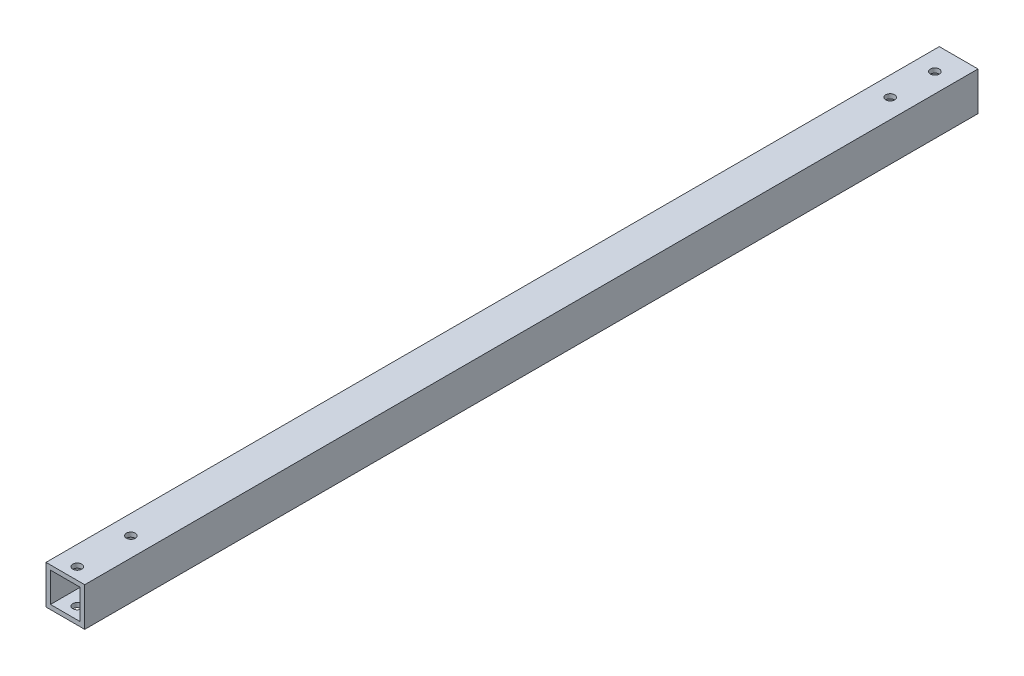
ISO-10303-21;
HEADER;
FILE_DESCRIPTION(('STEP AP214'),'2;1');
FILE_NAME('part.step','',(''),(''),'','','');
FILE_SCHEMA(('AUTOMOTIVE_DESIGN { 1 0 10303 214 1 1 1 1 }'));
ENDSEC;
DATA;
#1=APPLICATION_CONTEXT('core data for automotive mechanical design processes');
#2=APPLICATION_PROTOCOL_DEFINITION('international standard','automotive_design',2000,#1);
#3=PRODUCT_CONTEXT('',#1,'mechanical');
#4=PRODUCT('Part','Part','',(#3));
#5=PRODUCT_RELATED_PRODUCT_CATEGORY('part','',(#4));
#6=PRODUCT_DEFINITION_FORMATION('','',#4);
#7=PRODUCT_DEFINITION_CONTEXT('part definition',#1,'design');
#8=PRODUCT_DEFINITION('design','',#6,#7);
#9=PRODUCT_DEFINITION_SHAPE('','',#8);
#10=(LENGTH_UNIT() NAMED_UNIT(*) SI_UNIT(.MILLI.,.METRE.));
#11=(NAMED_UNIT(*) PLANE_ANGLE_UNIT() SI_UNIT($,.RADIAN.));
#12=(NAMED_UNIT(*) SI_UNIT($,.STERADIAN.) SOLID_ANGLE_UNIT());
#13=UNCERTAINTY_MEASURE_WITH_UNIT(LENGTH_MEASURE(1.E-05),#10,'distance_accuracy_value','');
#14=(GEOMETRIC_REPRESENTATION_CONTEXT(3) GLOBAL_UNCERTAINTY_ASSIGNED_CONTEXT((#13)) GLOBAL_UNIT_ASSIGNED_CONTEXT((#10,
#11,#12)) REPRESENTATION_CONTEXT('',''));
#15=CARTESIAN_POINT('',(0.,0.,0.));
#16=DIRECTION('',(0.,0.,1.));
#17=DIRECTION('',(1.,0.,0.));
#18=AXIS2_PLACEMENT_3D('',#15,#16,#17);
#19=CARTESIAN_POINT('',(6.5,6.5,300.));
#20=DIRECTION('',(-1.,0.,0.));
#21=DIRECTION('',(0.,-1.,0.));
#22=AXIS2_PLACEMENT_3D('',#19,#20,#21);
#23=PLANE('',#22);
#24=DIRECTION('',(0.,1.,0.));
#25=VECTOR('',#24,1.);
#26=CARTESIAN_POINT('',(6.5,6.5,0.));
#27=LINE('',#26,#25);
#28=CARTESIAN_POINT('',(6.5,-6.5,0.));
#29=VERTEX_POINT('',#28);
#30=CARTESIAN_POINT('',(6.5,6.5,0.));
#31=VERTEX_POINT('',#30);
#32=EDGE_CURVE('E148',#29,#31,#27,.T.);
#33=ORIENTED_EDGE('',*,*,#32,.T.);
#34=DIRECTION('',(0.,0.,-1.));
#35=VECTOR('',#34,1.);
#36=CARTESIAN_POINT('',(6.5,6.5,300.));
#37=LINE('',#36,#35);
#38=CARTESIAN_POINT('',(6.5,6.5,300.));
#39=VERTEX_POINT('',#38);
#40=EDGE_CURVE('E11',#39,#31,#37,.T.);
#41=ORIENTED_EDGE('',*,*,#40,.F.);
#42=DIRECTION('',(0.,1.,0.));
#43=VECTOR('',#42,1.);
#44=CARTESIAN_POINT('',(6.5,6.5,300.));
#45=LINE('',#44,#43);
#46=CARTESIAN_POINT('',(6.5,-6.5,300.));
#47=VERTEX_POINT('',#46);
#48=EDGE_CURVE('E137',#47,#39,#45,.T.);
#49=ORIENTED_EDGE('',*,*,#48,.F.);
#50=DIRECTION('',(0.,0.,-1.));
#51=VECTOR('',#50,1.);
#52=CARTESIAN_POINT('',(6.5,-6.5,300.));
#53=LINE('',#52,#51);
#54=EDGE_CURVE('E147',#47,#29,#53,.T.);
#55=ORIENTED_EDGE('',*,*,#54,.T.);
#56=EDGE_LOOP('',(#33,#41,#49,#55));
#57=FACE_BOUND('',#56,.T.);
#58=ADVANCED_FACE('F37',(#57),#23,.F.);
#59=CARTESIAN_POINT('',(-6.5,6.5,300.));
#60=DIRECTION('',(0.,-1.,0.));
#61=DIRECTION('',(0.,0.,-1.));
#62=AXIS2_PLACEMENT_3D('',#59,#60,#61);
#63=PLANE('',#62);
#64=CARTESIAN_POINT('',(0.,6.5,278.));
#65=DIRECTION('',(0.,1.,0.));
#66=DIRECTION('',(0.,0.,1.));
#67=AXIS2_PLACEMENT_3D('',#64,#65,#66);
#68=CIRCLE('',#67,1.5);
#69=CARTESIAN_POINT('',(0.,6.5,279.5));
#70=VERTEX_POINT('',#69);
#71=EDGE_CURVE('E311',#70,#70,#68,.T.);
#72=ORIENTED_EDGE('',*,*,#71,.F.);
#73=EDGE_LOOP('',(#72));
#74=FACE_BOUND('',#73,.T.);
#75=CARTESIAN_POINT('',(0.,6.5,296.));
#76=DIRECTION('',(0.,1.,0.));
#77=DIRECTION('',(0.,0.,1.));
#78=AXIS2_PLACEMENT_3D('',#75,#76,#77);
#79=CIRCLE('',#78,1.5);
#80=CARTESIAN_POINT('',(0.,6.5,297.5));
#81=VERTEX_POINT('',#80);
#82=EDGE_CURVE('E181',#81,#81,#79,.T.);
#83=ORIENTED_EDGE('',*,*,#82,.F.);
#84=EDGE_LOOP('',(#83));
#85=FACE_BOUND('',#84,.T.);
#86=CARTESIAN_POINT('',(0.,6.5,23.));
#87=DIRECTION('',(0.,1.,0.));
#88=DIRECTION('',(0.,0.,1.));
#89=AXIS2_PLACEMENT_3D('',#86,#87,#88);
#90=CIRCLE('',#89,1.5);
#91=CARTESIAN_POINT('',(0.,6.5,24.5));
#92=VERTEX_POINT('',#91);
#93=EDGE_CURVE('E178',#92,#92,#90,.T.);
#94=ORIENTED_EDGE('',*,*,#93,.F.);
#95=EDGE_LOOP('',(#94));
#96=FACE_BOUND('',#95,.T.);
#97=CARTESIAN_POINT('',(0.,6.5,8.));
#98=DIRECTION('',(0.,1.,0.));
#99=DIRECTION('',(0.,0.,1.));
#100=AXIS2_PLACEMENT_3D('',#97,#98,#99);
#101=CIRCLE('',#100,1.5);
#102=CARTESIAN_POINT('',(0.,6.5,9.5));
#103=VERTEX_POINT('',#102);
#104=EDGE_CURVE('E197',#103,#103,#101,.T.);
#105=ORIENTED_EDGE('',*,*,#104,.F.);
#106=EDGE_LOOP('',(#105));
#107=FACE_BOUND('',#106,.T.);
#108=DIRECTION('',(-1.,0.,0.));
#109=VECTOR('',#108,1.);
#110=CARTESIAN_POINT('',(-6.5,6.5,0.));
#111=LINE('',#110,#109);
#112=CARTESIAN_POINT('',(-6.5,6.5,0.));
#113=VERTEX_POINT('',#112);
#114=EDGE_CURVE('E151',#31,#113,#111,.T.);
#115=ORIENTED_EDGE('',*,*,#114,.T.);
#116=DIRECTION('',(0.,0.,-1.));
#117=VECTOR('',#116,1.);
#118=CARTESIAN_POINT('',(-6.5,6.5,300.));
#119=LINE('',#118,#117);
#120=CARTESIAN_POINT('',(-6.5,6.5,300.));
#121=VERTEX_POINT('',#120);
#122=EDGE_CURVE('E45',#121,#113,#119,.T.);
#123=ORIENTED_EDGE('',*,*,#122,.F.);
#124=DIRECTION('',(-1.,0.,0.));
#125=VECTOR('',#124,1.);
#126=CARTESIAN_POINT('',(-6.5,6.5,300.));
#127=LINE('',#126,#125);
#128=EDGE_CURVE('E140',#39,#121,#127,.T.);
#129=ORIENTED_EDGE('',*,*,#128,.F.);
#130=ORIENTED_EDGE('',*,*,#40,.T.);
#131=EDGE_LOOP('',(#115,#123,#129,#130));
#132=FACE_BOUND('',#131,.T.);
#133=ADVANCED_FACE('F226',(#74,#85,#96,#107,#132),#63,.F.);
#134=CARTESIAN_POINT('',(-6.5,6.5,300.));
#135=DIRECTION('',(1.,0.,0.));
#136=DIRECTION('',(0.,1.,0.));
#137=AXIS2_PLACEMENT_3D('',#134,#135,#136);
#138=PLANE('',#137);
#139=DIRECTION('',(0.,-1.,0.));
#140=VECTOR('',#139,1.);
#141=CARTESIAN_POINT('',(-6.5,6.5,0.));
#142=LINE('',#141,#140);
#143=CARTESIAN_POINT('',(-6.5,-6.5,0.));
#144=VERTEX_POINT('',#143);
#145=EDGE_CURVE('E153',#113,#144,#142,.T.);
#146=ORIENTED_EDGE('',*,*,#145,.T.);
#147=DIRECTION('',(0.,0.,-1.));
#148=VECTOR('',#147,1.);
#149=CARTESIAN_POINT('',(-6.5,-6.5,300.));
#150=LINE('',#149,#148);
#151=CARTESIAN_POINT('',(-6.5,-6.5,300.));
#152=VERTEX_POINT('',#151);
#153=EDGE_CURVE('E158',#152,#144,#150,.T.);
#154=ORIENTED_EDGE('',*,*,#153,.F.);
#155=DIRECTION('',(0.,-1.,0.));
#156=VECTOR('',#155,1.);
#157=CARTESIAN_POINT('',(-6.5,6.5,300.));
#158=LINE('',#157,#156);
#159=EDGE_CURVE('E143',#121,#152,#158,.T.);
#160=ORIENTED_EDGE('',*,*,#159,.F.);
#161=ORIENTED_EDGE('',*,*,#122,.T.);
#162=EDGE_LOOP('',(#146,#154,#160,#161));
#163=FACE_BOUND('',#162,.T.);
#164=ADVANCED_FACE('F231',(#163),#138,.F.);
#165=CARTESIAN_POINT('',(-6.5,-6.5,300.));
#166=DIRECTION('',(0.,1.,0.));
#167=DIRECTION('',(0.,0.,1.));
#168=AXIS2_PLACEMENT_3D('',#165,#166,#167);
#169=PLANE('',#168);
#170=CARTESIAN_POINT('',(0.,-6.5,278.));
#171=DIRECTION('',(0.,1.,0.));
#172=DIRECTION('',(0.,0.,1.));
#173=AXIS2_PLACEMENT_3D('',#170,#171,#172);
#174=CIRCLE('',#173,1.5);
#175=CARTESIAN_POINT('',(0.,-6.5,279.5));
#176=VERTEX_POINT('',#175);
#177=EDGE_CURVE('E310',#176,#176,#174,.T.);
#178=ORIENTED_EDGE('',*,*,#177,.T.);
#179=EDGE_LOOP('',(#178));
#180=FACE_BOUND('',#179,.T.);
#181=CARTESIAN_POINT('',(0.,-6.5,296.));
#182=DIRECTION('',(0.,1.,0.));
#183=DIRECTION('',(0.,0.,1.));
#184=AXIS2_PLACEMENT_3D('',#181,#182,#183);
#185=CIRCLE('',#184,1.5);
#186=CARTESIAN_POINT('',(0.,-6.5,297.5));
#187=VERTEX_POINT('',#186);
#188=EDGE_CURVE('E174',#187,#187,#185,.T.);
#189=ORIENTED_EDGE('',*,*,#188,.T.);
#190=EDGE_LOOP('',(#189));
#191=FACE_BOUND('',#190,.T.);
#192=CARTESIAN_POINT('',(0.,-6.5,23.));
#193=DIRECTION('',(0.,1.,0.));
#194=DIRECTION('',(0.,0.,1.));
#195=AXIS2_PLACEMENT_3D('',#192,#193,#194);
#196=CIRCLE('',#195,1.5);
#197=CARTESIAN_POINT('',(0.,-6.5,24.5));
#198=VERTEX_POINT('',#197);
#199=EDGE_CURVE('E170',#198,#198,#196,.T.);
#200=ORIENTED_EDGE('',*,*,#199,.T.);
#201=EDGE_LOOP('',(#200));
#202=FACE_BOUND('',#201,.T.);
#203=CARTESIAN_POINT('',(0.,-6.5,8.));
#204=DIRECTION('',(0.,1.,0.));
#205=DIRECTION('',(0.,0.,1.));
#206=AXIS2_PLACEMENT_3D('',#203,#204,#205);
#207=CIRCLE('',#206,1.5);
#208=CARTESIAN_POINT('',(0.,-6.5,9.5));
#209=VERTEX_POINT('',#208);
#210=EDGE_CURVE('E166',#209,#209,#207,.T.);
#211=ORIENTED_EDGE('',*,*,#210,.T.);
#212=EDGE_LOOP('',(#211));
#213=FACE_BOUND('',#212,.T.);
#214=DIRECTION('',(1.,0.,0.));
#215=VECTOR('',#214,1.);
#216=CARTESIAN_POINT('',(-6.5,-6.5,0.));
#217=LINE('',#216,#215);
#218=EDGE_CURVE('E141',#144,#29,#217,.T.);
#219=ORIENTED_EDGE('',*,*,#218,.T.);
#220=ORIENTED_EDGE('',*,*,#54,.F.);
#221=DIRECTION('',(1.,0.,0.));
#222=VECTOR('',#221,1.);
#223=CARTESIAN_POINT('',(-6.5,-6.5,300.));
#224=LINE('',#223,#222);
#225=EDGE_CURVE('E145',#152,#47,#224,.T.);
#226=ORIENTED_EDGE('',*,*,#225,.F.);
#227=ORIENTED_EDGE('',*,*,#153,.T.);
#228=EDGE_LOOP('',(#219,#220,#226,#227));
#229=FACE_BOUND('',#228,.T.);
#230=ADVANCED_FACE('F245',(#180,#191,#202,#213,#229),#169,.F.);
#231=CARTESIAN_POINT('',(0.,0.,300.));
#232=DIRECTION('',(0.,0.,1.));
#233=DIRECTION('',(1.,0.,0.));
#234=AXIS2_PLACEMENT_3D('',#231,#232,#233);
#235=PLANE('',#234);
#236=DIRECTION('',(0.,1.,0.));
#237=VECTOR('',#236,1.);
#238=CARTESIAN_POINT('',(5.,6.5,300.));
#239=LINE('',#238,#237);
#240=CARTESIAN_POINT('',(5.,-5.,300.));
#241=VERTEX_POINT('',#240);
#242=CARTESIAN_POINT('',(5.,5.,300.));
#243=VERTEX_POINT('',#242);
#244=EDGE_CURVE('E125',#241,#243,#239,.T.);
#245=ORIENTED_EDGE('',*,*,#244,.F.);
#246=DIRECTION('',(1.,0.,0.));
#247=VECTOR('',#246,1.);
#248=CARTESIAN_POINT('',(-6.5,-5.,300.));
#249=LINE('',#248,#247);
#250=CARTESIAN_POINT('',(-5.,-5.,300.));
#251=VERTEX_POINT('',#250);
#252=EDGE_CURVE('E108',#251,#241,#249,.T.);
#253=ORIENTED_EDGE('',*,*,#252,.F.);
#254=DIRECTION('',(0.,-1.,0.));
#255=VECTOR('',#254,1.);
#256=CARTESIAN_POINT('',(-5.,6.5,300.));
#257=LINE('',#256,#255);
#258=CARTESIAN_POINT('',(-5.,5.,300.));
#259=VERTEX_POINT('',#258);
#260=EDGE_CURVE('E134',#259,#251,#257,.T.);
#261=ORIENTED_EDGE('',*,*,#260,.F.);
#262=DIRECTION('',(-1.,0.,0.));
#263=VECTOR('',#262,1.);
#264=CARTESIAN_POINT('',(-6.5,5.,300.));
#265=LINE('',#264,#263);
#266=EDGE_CURVE('E127',#243,#259,#265,.T.);
#267=ORIENTED_EDGE('',*,*,#266,.F.);
#268=EDGE_LOOP('',(#245,#253,#261,#267));
#269=FACE_BOUND('',#268,.T.);
#270=ORIENTED_EDGE('',*,*,#48,.T.);
#271=ORIENTED_EDGE('',*,*,#128,.T.);
#272=ORIENTED_EDGE('',*,*,#159,.T.);
#273=ORIENTED_EDGE('',*,*,#225,.T.);
#274=EDGE_LOOP('',(#270,#271,#272,#273));
#275=FACE_BOUND('',#274,.T.);
#276=ADVANCED_FACE('F210',(#269,#275),#235,.T.);
#277=CARTESIAN_POINT('',(0.,0.,0.));
#278=DIRECTION('',(0.,0.,1.));
#279=DIRECTION('',(1.,0.,0.));
#280=AXIS2_PLACEMENT_3D('',#277,#278,#279);
#281=PLANE('',#280);
#282=DIRECTION('',(1.,0.,0.));
#283=VECTOR('',#282,1.);
#284=CARTESIAN_POINT('',(-6.5,-5.,0.));
#285=LINE('',#284,#283);
#286=CARTESIAN_POINT('',(-5.,-5.,0.));
#287=VERTEX_POINT('',#286);
#288=CARTESIAN_POINT('',(5.,-5.,0.));
#289=VERTEX_POINT('',#288);
#290=EDGE_CURVE('E106',#287,#289,#285,.T.);
#291=ORIENTED_EDGE('',*,*,#290,.T.);
#292=DIRECTION('',(0.,1.,0.));
#293=VECTOR('',#292,1.);
#294=CARTESIAN_POINT('',(5.,6.5,0.));
#295=LINE('',#294,#293);
#296=CARTESIAN_POINT('',(5.,5.,0.));
#297=VERTEX_POINT('',#296);
#298=EDGE_CURVE('E114',#289,#297,#295,.T.);
#299=ORIENTED_EDGE('',*,*,#298,.T.);
#300=DIRECTION('',(-1.,0.,0.));
#301=VECTOR('',#300,1.);
#302=CARTESIAN_POINT('',(-6.5,5.,0.));
#303=LINE('',#302,#301);
#304=CARTESIAN_POINT('',(-5.,5.,0.));
#305=VERTEX_POINT('',#304);
#306=EDGE_CURVE('E120',#297,#305,#303,.T.);
#307=ORIENTED_EDGE('',*,*,#306,.T.);
#308=DIRECTION('',(0.,-1.,0.));
#309=VECTOR('',#308,1.);
#310=CARTESIAN_POINT('',(-5.,6.5,0.));
#311=LINE('',#310,#309);
#312=EDGE_CURVE('E60',#305,#287,#311,.T.);
#313=ORIENTED_EDGE('',*,*,#312,.T.);
#314=EDGE_LOOP('',(#291,#299,#307,#313));
#315=FACE_BOUND('',#314,.T.);
#316=ORIENTED_EDGE('',*,*,#32,.F.);
#317=ORIENTED_EDGE('',*,*,#218,.F.);
#318=ORIENTED_EDGE('',*,*,#145,.F.);
#319=ORIENTED_EDGE('',*,*,#114,.F.);
#320=EDGE_LOOP('',(#316,#317,#318,#319));
#321=FACE_BOUND('',#320,.T.);
#322=ADVANCED_FACE('F123',(#315,#321),#281,.F.);
#323=CARTESIAN_POINT('',(5.,6.5,300.));
#324=DIRECTION('',(-1.,0.,0.));
#325=DIRECTION('',(0.,-1.,0.));
#326=AXIS2_PLACEMENT_3D('',#323,#324,#325);
#327=PLANE('',#326);
#328=ORIENTED_EDGE('',*,*,#298,.F.);
#329=DIRECTION('',(0.,0.,-1.));
#330=VECTOR('',#329,1.);
#331=CARTESIAN_POINT('',(5.,-5.,300.));
#332=LINE('',#331,#330);
#333=EDGE_CURVE('E102',#241,#289,#332,.T.);
#334=ORIENTED_EDGE('',*,*,#333,.F.);
#335=ORIENTED_EDGE('',*,*,#244,.T.);
#336=DIRECTION('',(0.,0.,-1.));
#337=VECTOR('',#336,1.);
#338=CARTESIAN_POINT('',(5.,5.,300.));
#339=LINE('',#338,#337);
#340=EDGE_CURVE('E117',#243,#297,#339,.T.);
#341=ORIENTED_EDGE('',*,*,#340,.T.);
#342=EDGE_LOOP('',(#328,#334,#335,#341));
#343=FACE_BOUND('',#342,.T.);
#344=ADVANCED_FACE('F115',(#343),#327,.T.);
#345=CARTESIAN_POINT('',(-6.5,5.,300.));
#346=DIRECTION('',(0.,-1.,0.));
#347=DIRECTION('',(0.,0.,-1.));
#348=AXIS2_PLACEMENT_3D('',#345,#346,#347);
#349=PLANE('',#348);
#350=CARTESIAN_POINT('',(0.,5.,278.));
#351=DIRECTION('',(0.,-1.,0.));
#352=DIRECTION('',(0.,0.,-1.));
#353=AXIS2_PLACEMENT_3D('',#350,#351,#352);
#354=CIRCLE('',#353,1.5);
#355=CARTESIAN_POINT('',(0.,5.,279.5));
#356=VERTEX_POINT('',#355);
#357=EDGE_CURVE('E186',#356,#356,#354,.T.);
#358=ORIENTED_EDGE('',*,*,#357,.F.);
#359=EDGE_LOOP('',(#358));
#360=FACE_BOUND('',#359,.T.);
#361=CARTESIAN_POINT('',(0.,5.,296.));
#362=DIRECTION('',(0.,-1.,0.));
#363=DIRECTION('',(0.,0.,-1.));
#364=AXIS2_PLACEMENT_3D('',#361,#362,#363);
#365=CIRCLE('',#364,1.5);
#366=CARTESIAN_POINT('',(0.,5.,297.5));
#367=VERTEX_POINT('',#366);
#368=EDGE_CURVE('E173',#367,#367,#365,.T.);
#369=ORIENTED_EDGE('',*,*,#368,.F.);
#370=EDGE_LOOP('',(#369));
#371=FACE_BOUND('',#370,.T.);
#372=CARTESIAN_POINT('',(0.,5.,23.));
#373=DIRECTION('',(0.,-1.,0.));
#374=DIRECTION('',(0.,0.,-1.));
#375=AXIS2_PLACEMENT_3D('',#372,#373,#374);
#376=CIRCLE('',#375,1.5);
#377=CARTESIAN_POINT('',(0.,5.,24.5));
#378=VERTEX_POINT('',#377);
#379=EDGE_CURVE('E169',#378,#378,#376,.T.);
#380=ORIENTED_EDGE('',*,*,#379,.F.);
#381=EDGE_LOOP('',(#380));
#382=FACE_BOUND('',#381,.T.);
#383=CARTESIAN_POINT('',(0.,5.,8.));
#384=DIRECTION('',(0.,-1.,0.));
#385=DIRECTION('',(0.,0.,-1.));
#386=AXIS2_PLACEMENT_3D('',#383,#384,#385);
#387=CIRCLE('',#386,1.5);
#388=CARTESIAN_POINT('',(0.,5.,9.5));
#389=VERTEX_POINT('',#388);
#390=EDGE_CURVE('E121',#389,#389,#387,.T.);
#391=ORIENTED_EDGE('',*,*,#390,.F.);
#392=EDGE_LOOP('',(#391));
#393=FACE_BOUND('',#392,.T.);
#394=ORIENTED_EDGE('',*,*,#306,.F.);
#395=ORIENTED_EDGE('',*,*,#340,.F.);
#396=ORIENTED_EDGE('',*,*,#266,.T.);
#397=DIRECTION('',(0.,0.,-1.));
#398=VECTOR('',#397,1.);
#399=CARTESIAN_POINT('',(-5.,5.,300.));
#400=LINE('',#399,#398);
#401=EDGE_CURVE('E204',#259,#305,#400,.T.);
#402=ORIENTED_EDGE('',*,*,#401,.T.);
#403=EDGE_LOOP('',(#394,#395,#396,#402));
#404=FACE_BOUND('',#403,.T.);
#405=ADVANCED_FACE('F213',(#360,#371,#382,#393,#404),#349,.T.);
#406=CARTESIAN_POINT('',(-5.,6.5,300.));
#407=DIRECTION('',(1.,0.,0.));
#408=DIRECTION('',(0.,1.,0.));
#409=AXIS2_PLACEMENT_3D('',#406,#407,#408);
#410=PLANE('',#409);
#411=ORIENTED_EDGE('',*,*,#312,.F.);
#412=ORIENTED_EDGE('',*,*,#401,.F.);
#413=ORIENTED_EDGE('',*,*,#260,.T.);
#414=DIRECTION('',(0.,0.,-1.));
#415=VECTOR('',#414,1.);
#416=CARTESIAN_POINT('',(-5.,-5.,300.));
#417=LINE('',#416,#415);
#418=EDGE_CURVE('E53',#251,#287,#417,.T.);
#419=ORIENTED_EDGE('',*,*,#418,.T.);
#420=EDGE_LOOP('',(#411,#412,#413,#419));
#421=FACE_BOUND('',#420,.T.);
#422=ADVANCED_FACE('F206',(#421),#410,.T.);
#423=CARTESIAN_POINT('',(-6.5,-5.,300.));
#424=DIRECTION('',(0.,1.,0.));
#425=DIRECTION('',(0.,0.,1.));
#426=AXIS2_PLACEMENT_3D('',#423,#424,#425);
#427=PLANE('',#426);
#428=CARTESIAN_POINT('',(0.,-5.,278.));
#429=DIRECTION('',(0.,1.,0.));
#430=DIRECTION('',(0.,0.,1.));
#431=AXIS2_PLACEMENT_3D('',#428,#429,#430);
#432=CIRCLE('',#431,1.5);
#433=CARTESIAN_POINT('',(0.,-5.,279.5));
#434=VERTEX_POINT('',#433);
#435=EDGE_CURVE('E40',#434,#434,#432,.T.);
#436=ORIENTED_EDGE('',*,*,#435,.F.);
#437=EDGE_LOOP('',(#436));
#438=FACE_BOUND('',#437,.T.);
#439=CARTESIAN_POINT('',(0.,-5.,296.));
#440=DIRECTION('',(0.,1.,0.));
#441=DIRECTION('',(0.,0.,1.));
#442=AXIS2_PLACEMENT_3D('',#439,#440,#441);
#443=CIRCLE('',#442,1.5);
#444=CARTESIAN_POINT('',(0.,-5.,297.5));
#445=VERTEX_POINT('',#444);
#446=EDGE_CURVE('E171',#445,#445,#443,.T.);
#447=ORIENTED_EDGE('',*,*,#446,.F.);
#448=EDGE_LOOP('',(#447));
#449=FACE_BOUND('',#448,.T.);
#450=CARTESIAN_POINT('',(0.,-5.,23.));
#451=DIRECTION('',(0.,1.,0.));
#452=DIRECTION('',(0.,0.,1.));
#453=AXIS2_PLACEMENT_3D('',#450,#451,#452);
#454=CIRCLE('',#453,1.5);
#455=CARTESIAN_POINT('',(0.,-5.,24.5));
#456=VERTEX_POINT('',#455);
#457=EDGE_CURVE('E167',#456,#456,#454,.T.);
#458=ORIENTED_EDGE('',*,*,#457,.F.);
#459=EDGE_LOOP('',(#458));
#460=FACE_BOUND('',#459,.T.);
#461=CARTESIAN_POINT('',(0.,-5.,8.));
#462=DIRECTION('',(0.,1.,0.));
#463=DIRECTION('',(0.,0.,1.));
#464=AXIS2_PLACEMENT_3D('',#461,#462,#463);
#465=CIRCLE('',#464,1.5);
#466=CARTESIAN_POINT('',(0.,-5.,9.5));
#467=VERTEX_POINT('',#466);
#468=EDGE_CURVE('E163',#467,#467,#465,.T.);
#469=ORIENTED_EDGE('',*,*,#468,.F.);
#470=EDGE_LOOP('',(#469));
#471=FACE_BOUND('',#470,.T.);
#472=ORIENTED_EDGE('',*,*,#290,.F.);
#473=ORIENTED_EDGE('',*,*,#418,.F.);
#474=ORIENTED_EDGE('',*,*,#252,.T.);
#475=ORIENTED_EDGE('',*,*,#333,.T.);
#476=EDGE_LOOP('',(#472,#473,#474,#475));
#477=FACE_BOUND('',#476,.T.);
#478=ADVANCED_FACE('F104',(#438,#449,#460,#471,#477),#427,.T.);
#479=CARTESIAN_POINT('',(0.,-6.5,8.));
#480=DIRECTION('',(0.,1.,0.));
#481=DIRECTION('',(0.,0.,1.));
#482=AXIS2_PLACEMENT_3D('',#479,#480,#481);
#483=CYLINDRICAL_SURFACE('',#482,1.5);
#484=CARTESIAN_POINT('',(0.,-5.,9.5));
#485=CARTESIAN_POINT('',(0.,-5.015625,9.5));
#486=CARTESIAN_POINT('',(0.,-5.03125,9.5));
#487=CARTESIAN_POINT('',(0.,-5.0625,9.5));
#488=CARTESIAN_POINT('',(0.,-5.078125,9.5));
#489=CARTESIAN_POINT('',(0.,-5.109375,9.5));
#490=CARTESIAN_POINT('',(0.,-5.125,9.5));
#491=CARTESIAN_POINT('',(0.,-5.15625,9.5));
#492=CARTESIAN_POINT('',(0.,-5.171875,9.5));
#493=CARTESIAN_POINT('',(0.,-5.203125,9.5));
#494=CARTESIAN_POINT('',(0.,-5.21875,9.5));
#495=CARTESIAN_POINT('',(0.,-5.25,9.5));
#496=CARTESIAN_POINT('',(0.,-5.265625,9.5));
#497=CARTESIAN_POINT('',(0.,-5.296875,9.5));
#498=CARTESIAN_POINT('',(0.,-5.3125,9.5));
#499=CARTESIAN_POINT('',(0.,-5.34375,9.5));
#500=CARTESIAN_POINT('',(0.,-5.359375,9.5));
#501=CARTESIAN_POINT('',(0.,-5.390625,9.5));
#502=CARTESIAN_POINT('',(0.,-5.40625,9.5));
#503=CARTESIAN_POINT('',(0.,-5.4375,9.5));
#504=CARTESIAN_POINT('',(0.,-5.453125,9.5));
#505=CARTESIAN_POINT('',(0.,-5.484375,9.5));
#506=CARTESIAN_POINT('',(0.,-5.5,9.5));
#507=CARTESIAN_POINT('',(0.,-5.53125,9.5));
#508=CARTESIAN_POINT('',(0.,-5.546875,9.5));
#509=CARTESIAN_POINT('',(0.,-5.578125,9.5));
#510=CARTESIAN_POINT('',(0.,-5.59375,9.5));
#511=CARTESIAN_POINT('',(0.,-5.625,9.5));
#512=CARTESIAN_POINT('',(0.,-5.640625,9.5));
#513=CARTESIAN_POINT('',(0.,-5.671875,9.5));
#514=CARTESIAN_POINT('',(0.,-5.6875,9.5));
#515=CARTESIAN_POINT('',(0.,-5.71875,9.5));
#516=CARTESIAN_POINT('',(0.,-5.734375,9.5));
#517=CARTESIAN_POINT('',(0.,-5.765625,9.5));
#518=CARTESIAN_POINT('',(0.,-5.78125,9.5));
#519=CARTESIAN_POINT('',(0.,-5.8125,9.5));
#520=CARTESIAN_POINT('',(0.,-5.828125,9.5));
#521=CARTESIAN_POINT('',(0.,-5.859375,9.5));
#522=CARTESIAN_POINT('',(0.,-5.875,9.5));
#523=CARTESIAN_POINT('',(0.,-5.90625,9.5));
#524=CARTESIAN_POINT('',(0.,-5.921875,9.5));
#525=CARTESIAN_POINT('',(0.,-5.953125,9.5));
#526=CARTESIAN_POINT('',(0.,-5.96875,9.5));
#527=CARTESIAN_POINT('',(0.,-6.,9.5));
#528=CARTESIAN_POINT('',(0.,-6.015625,9.5));
#529=CARTESIAN_POINT('',(0.,-6.046875,9.5));
#530=CARTESIAN_POINT('',(0.,-6.0625,9.5));
#531=CARTESIAN_POINT('',(0.,-6.09375,9.5));
#532=CARTESIAN_POINT('',(0.,-6.109375,9.5));
#533=CARTESIAN_POINT('',(0.,-6.140625,9.5));
#534=CARTESIAN_POINT('',(0.,-6.15625,9.5));
#535=CARTESIAN_POINT('',(0.,-6.1875,9.5));
#536=CARTESIAN_POINT('',(0.,-6.203125,9.5));
#537=CARTESIAN_POINT('',(0.,-6.234375,9.5));
#538=CARTESIAN_POINT('',(0.,-6.25,9.5));
#539=CARTESIAN_POINT('',(0.,-6.28125,9.5));
#540=CARTESIAN_POINT('',(0.,-6.296875,9.5));
#541=CARTESIAN_POINT('',(0.,-6.328125,9.5));
#542=CARTESIAN_POINT('',(0.,-6.34375,9.5));
#543=CARTESIAN_POINT('',(0.,-6.375,9.5));
#544=CARTESIAN_POINT('',(0.,-6.390625,9.5));
#545=CARTESIAN_POINT('',(0.,-6.421875,9.5));
#546=CARTESIAN_POINT('',(0.,-6.4375,9.5));
#547=CARTESIAN_POINT('',(0.,-6.46875,9.5));
#548=CARTESIAN_POINT('',(0.,-6.484375,9.5));
#549=CARTESIAN_POINT('',(0.,-6.5,9.5));
#550=B_SPLINE_CURVE_WITH_KNOTS('',3,(#484,#485,#486,#487,#488,#489,#490,#491,#492,#493,#494,
#495,#496,#497,#498,#499,#500,#501,#502,#503,#504,#505,#506,#507,#508,#509,#510,#511,#512,#513,
#514,#515,#516,#517,#518,#519,#520,#521,#522,#523,#524,#525,#526,#527,#528,#529,#530,#531,#532,
#533,#534,#535,#536,#537,#538,#539,#540,#541,#542,#543,#544,#545,#546,#547,#548,#549),
.UNSPECIFIED.,.F.,.F.,(4,2,2,2,2,2,2,2,2,2,2,2,2,2,2,2,2,2,2,2,2,2,2,2,2,2,2,2,2,2,2,2,4),(0.,
0.046875,0.0937500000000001,0.140625,0.1875,0.234374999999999,0.281249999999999,
0.328124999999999,0.374999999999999,0.421875,0.46875,0.515625,0.5625,0.609375,0.65625,0.703125,
0.75,0.796875,0.84375,0.890625,0.9375,0.984375,1.03125,1.078125,1.125,1.171875,1.21875,1.265625,
1.3125,1.359375,1.40625,1.453125,1.5),.UNSPECIFIED.);
#551=EDGE_CURVE('BSEAM260',#467,#209,#550,.T.);
#552=ORIENTED_EDGE('',*,*,#468,.T.);
#553=ORIENTED_EDGE('',*,*,#210,.F.);
#554=ORIENTED_EDGE('',*,*,#551,.T.);
#555=ORIENTED_EDGE('',*,*,#551,.F.);
#556=EDGE_LOOP('',(#552,#554,#553,#555));
#557=FACE_BOUND('',#556,.T.);
#558=ADVANCED_FACE('F260',(#557),#483,.F.);
#559=CARTESIAN_POINT('',(0.,5.,9.5));
#560=CARTESIAN_POINT('',(0.,5.015625,9.5));
#561=CARTESIAN_POINT('',(0.,5.03125,9.5));
#562=CARTESIAN_POINT('',(0.,5.0625,9.5));
#563=CARTESIAN_POINT('',(0.,5.078125,9.5));
#564=CARTESIAN_POINT('',(0.,5.109375,9.5));
#565=CARTESIAN_POINT('',(0.,5.125,9.5));
#566=CARTESIAN_POINT('',(0.,5.15625,9.5));
#567=CARTESIAN_POINT('',(0.,5.171875,9.5));
#568=CARTESIAN_POINT('',(0.,5.203125,9.5));
#569=CARTESIAN_POINT('',(0.,5.21875,9.5));
#570=CARTESIAN_POINT('',(0.,5.25,9.5));
#571=CARTESIAN_POINT('',(0.,5.265625,9.5));
#572=CARTESIAN_POINT('',(0.,5.296875,9.5));
#573=CARTESIAN_POINT('',(0.,5.3125,9.5));
#574=CARTESIAN_POINT('',(0.,5.34375,9.5));
#575=CARTESIAN_POINT('',(0.,5.359375,9.5));
#576=CARTESIAN_POINT('',(0.,5.390625,9.5));
#577=CARTESIAN_POINT('',(0.,5.40625,9.5));
#578=CARTESIAN_POINT('',(0.,5.4375,9.5));
#579=CARTESIAN_POINT('',(0.,5.453125,9.5));
#580=CARTESIAN_POINT('',(0.,5.484375,9.5));
#581=CARTESIAN_POINT('',(0.,5.5,9.5));
#582=CARTESIAN_POINT('',(0.,5.53125,9.5));
#583=CARTESIAN_POINT('',(0.,5.546875,9.5));
#584=CARTESIAN_POINT('',(0.,5.578125,9.5));
#585=CARTESIAN_POINT('',(0.,5.59375,9.5));
#586=CARTESIAN_POINT('',(0.,5.625,9.5));
#587=CARTESIAN_POINT('',(0.,5.640625,9.5));
#588=CARTESIAN_POINT('',(0.,5.671875,9.5));
#589=CARTESIAN_POINT('',(0.,5.6875,9.5));
#590=CARTESIAN_POINT('',(0.,5.71875,9.5));
#591=CARTESIAN_POINT('',(0.,5.734375,9.5));
#592=CARTESIAN_POINT('',(0.,5.765625,9.5));
#593=CARTESIAN_POINT('',(0.,5.78125,9.5));
#594=CARTESIAN_POINT('',(0.,5.8125,9.5));
#595=CARTESIAN_POINT('',(0.,5.828125,9.5));
#596=CARTESIAN_POINT('',(0.,5.859375,9.5));
#597=CARTESIAN_POINT('',(0.,5.875,9.5));
#598=CARTESIAN_POINT('',(0.,5.90625,9.5));
#599=CARTESIAN_POINT('',(0.,5.921875,9.5));
#600=CARTESIAN_POINT('',(0.,5.953125,9.5));
#601=CARTESIAN_POINT('',(0.,5.96875,9.5));
#602=CARTESIAN_POINT('',(0.,6.,9.5));
#603=CARTESIAN_POINT('',(0.,6.015625,9.5));
#604=CARTESIAN_POINT('',(0.,6.046875,9.5));
#605=CARTESIAN_POINT('',(0.,6.0625,9.5));
#606=CARTESIAN_POINT('',(0.,6.09375,9.5));
#607=CARTESIAN_POINT('',(0.,6.109375,9.5));
#608=CARTESIAN_POINT('',(0.,6.140625,9.5));
#609=CARTESIAN_POINT('',(0.,6.15625,9.5));
#610=CARTESIAN_POINT('',(0.,6.1875,9.5));
#611=CARTESIAN_POINT('',(0.,6.203125,9.5));
#612=CARTESIAN_POINT('',(0.,6.234375,9.5));
#613=CARTESIAN_POINT('',(0.,6.25,9.5));
#614=CARTESIAN_POINT('',(0.,6.28125,9.5));
#615=CARTESIAN_POINT('',(0.,6.296875,9.5));
#616=CARTESIAN_POINT('',(0.,6.328125,9.5));
#617=CARTESIAN_POINT('',(0.,6.34375,9.5));
#618=CARTESIAN_POINT('',(0.,6.375,9.5));
#619=CARTESIAN_POINT('',(0.,6.390625,9.5));
#620=CARTESIAN_POINT('',(0.,6.421875,9.5));
#621=CARTESIAN_POINT('',(0.,6.4375,9.5));
#622=CARTESIAN_POINT('',(0.,6.46875,9.5));
#623=CARTESIAN_POINT('',(0.,6.484375,9.5));
#624=CARTESIAN_POINT('',(0.,6.5,9.5));
#625=B_SPLINE_CURVE_WITH_KNOTS('',3,(#559,#560,#561,#562,#563,#564,#565,#566,#567,#568,#569,
#570,#571,#572,#573,#574,#575,#576,#577,#578,#579,#580,#581,#582,#583,#584,#585,#586,#587,#588,
#589,#590,#591,#592,#593,#594,#595,#596,#597,#598,#599,#600,#601,#602,#603,#604,#605,#606,#607,
#608,#609,#610,#611,#612,#613,#614,#615,#616,#617,#618,#619,#620,#621,#622,#623,#624),
.UNSPECIFIED.,.F.,.F.,(4,2,2,2,2,2,2,2,2,2,2,2,2,2,2,2,2,2,2,2,2,2,2,2,2,2,2,2,2,2,2,2,4),(0.,
0.046875,0.0937500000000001,0.140625,0.1875,0.234375,0.28125,0.328125,0.375,0.421874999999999,
0.468749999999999,0.515624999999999,0.562499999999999,0.609374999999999,0.656249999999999,
0.703124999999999,0.749999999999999,0.796874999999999,0.843749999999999,0.890624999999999,
0.937499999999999,0.984374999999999,1.03125,1.078125,1.125,1.171875,1.21875,1.265625,1.3125,
1.359375,1.40625,1.453125,1.5),.UNSPECIFIED.);
#626=EDGE_CURVE('BSEAM265',#389,#103,#625,.T.);
#627=ORIENTED_EDGE('',*,*,#390,.T.);
#628=ORIENTED_EDGE('',*,*,#104,.T.);
#629=ORIENTED_EDGE('',*,*,#626,.T.);
#630=ORIENTED_EDGE('',*,*,#626,.F.);
#631=EDGE_LOOP('',(#627,#629,#628,#630));
#632=FACE_BOUND('',#631,.T.);
#633=ADVANCED_FACE('F265',(#632),#483,.F.);
#634=CARTESIAN_POINT('',(0.,-6.5,23.));
#635=DIRECTION('',(0.,1.,0.));
#636=DIRECTION('',(0.,0.,1.));
#637=AXIS2_PLACEMENT_3D('',#634,#635,#636);
#638=CYLINDRICAL_SURFACE('',#637,1.5);
#639=CARTESIAN_POINT('',(0.,-5.,24.5));
#640=CARTESIAN_POINT('',(0.,-5.015625,24.5));
#641=CARTESIAN_POINT('',(0.,-5.03125,24.5));
#642=CARTESIAN_POINT('',(0.,-5.0625,24.5));
#643=CARTESIAN_POINT('',(0.,-5.078125,24.5));
#644=CARTESIAN_POINT('',(0.,-5.109375,24.5));
#645=CARTESIAN_POINT('',(0.,-5.125,24.5));
#646=CARTESIAN_POINT('',(0.,-5.15625,24.5));
#647=CARTESIAN_POINT('',(0.,-5.171875,24.5));
#648=CARTESIAN_POINT('',(0.,-5.203125,24.5));
#649=CARTESIAN_POINT('',(0.,-5.21875,24.5));
#650=CARTESIAN_POINT('',(0.,-5.25,24.5));
#651=CARTESIAN_POINT('',(0.,-5.265625,24.5));
#652=CARTESIAN_POINT('',(0.,-5.296875,24.5));
#653=CARTESIAN_POINT('',(0.,-5.3125,24.5));
#654=CARTESIAN_POINT('',(0.,-5.34375,24.5));
#655=CARTESIAN_POINT('',(0.,-5.359375,24.5));
#656=CARTESIAN_POINT('',(0.,-5.390625,24.5));
#657=CARTESIAN_POINT('',(0.,-5.40625,24.5));
#658=CARTESIAN_POINT('',(0.,-5.4375,24.5));
#659=CARTESIAN_POINT('',(0.,-5.453125,24.5));
#660=CARTESIAN_POINT('',(0.,-5.484375,24.5));
#661=CARTESIAN_POINT('',(0.,-5.5,24.5));
#662=CARTESIAN_POINT('',(0.,-5.53125,24.5));
#663=CARTESIAN_POINT('',(0.,-5.546875,24.5));
#664=CARTESIAN_POINT('',(0.,-5.578125,24.5));
#665=CARTESIAN_POINT('',(0.,-5.59375,24.5));
#666=CARTESIAN_POINT('',(0.,-5.625,24.5));
#667=CARTESIAN_POINT('',(0.,-5.640625,24.5));
#668=CARTESIAN_POINT('',(0.,-5.671875,24.5));
#669=CARTESIAN_POINT('',(0.,-5.6875,24.5));
#670=CARTESIAN_POINT('',(0.,-5.71875,24.5));
#671=CARTESIAN_POINT('',(0.,-5.734375,24.5));
#672=CARTESIAN_POINT('',(0.,-5.765625,24.5));
#673=CARTESIAN_POINT('',(0.,-5.78125,24.5));
#674=CARTESIAN_POINT('',(0.,-5.8125,24.5));
#675=CARTESIAN_POINT('',(0.,-5.828125,24.5));
#676=CARTESIAN_POINT('',(0.,-5.859375,24.5));
#677=CARTESIAN_POINT('',(0.,-5.875,24.5));
#678=CARTESIAN_POINT('',(0.,-5.90625,24.5));
#679=CARTESIAN_POINT('',(0.,-5.921875,24.5));
#680=CARTESIAN_POINT('',(0.,-5.953125,24.5));
#681=CARTESIAN_POINT('',(0.,-5.96875,24.5));
#682=CARTESIAN_POINT('',(0.,-6.,24.5));
#683=CARTESIAN_POINT('',(0.,-6.015625,24.5));
#684=CARTESIAN_POINT('',(0.,-6.046875,24.5));
#685=CARTESIAN_POINT('',(0.,-6.0625,24.5));
#686=CARTESIAN_POINT('',(0.,-6.09375,24.5));
#687=CARTESIAN_POINT('',(0.,-6.109375,24.5));
#688=CARTESIAN_POINT('',(0.,-6.140625,24.5));
#689=CARTESIAN_POINT('',(0.,-6.15625,24.5));
#690=CARTESIAN_POINT('',(0.,-6.1875,24.5));
#691=CARTESIAN_POINT('',(0.,-6.203125,24.5));
#692=CARTESIAN_POINT('',(0.,-6.234375,24.5));
#693=CARTESIAN_POINT('',(0.,-6.25,24.5));
#694=CARTESIAN_POINT('',(0.,-6.28125,24.5));
#695=CARTESIAN_POINT('',(0.,-6.296875,24.5));
#696=CARTESIAN_POINT('',(0.,-6.328125,24.5));
#697=CARTESIAN_POINT('',(0.,-6.34375,24.5));
#698=CARTESIAN_POINT('',(0.,-6.375,24.5));
#699=CARTESIAN_POINT('',(0.,-6.390625,24.5));
#700=CARTESIAN_POINT('',(0.,-6.421875,24.5));
#701=CARTESIAN_POINT('',(0.,-6.4375,24.5));
#702=CARTESIAN_POINT('',(0.,-6.46875,24.5));
#703=CARTESIAN_POINT('',(0.,-6.484375,24.5));
#704=CARTESIAN_POINT('',(0.,-6.5,24.5));
#705=B_SPLINE_CURVE_WITH_KNOTS('',3,(#639,#640,#641,#642,#643,#644,#645,#646,#647,#648,#649,
#650,#651,#652,#653,#654,#655,#656,#657,#658,#659,#660,#661,#662,#663,#664,#665,#666,#667,#668,
#669,#670,#671,#672,#673,#674,#675,#676,#677,#678,#679,#680,#681,#682,#683,#684,#685,#686,#687,
#688,#689,#690,#691,#692,#693,#694,#695,#696,#697,#698,#699,#700,#701,#702,#703,#704),
.UNSPECIFIED.,.F.,.F.,(4,2,2,2,2,2,2,2,2,2,2,2,2,2,2,2,2,2,2,2,2,2,2,2,2,2,2,2,2,2,2,2,4),(0.,
0.046875,0.0937500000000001,0.140625,0.1875,0.234374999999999,0.281249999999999,
0.328124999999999,0.374999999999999,0.421875,0.46875,0.515625,0.5625,0.609375,0.65625,0.703125,
0.75,0.796875,0.84375,0.890625,0.9375,0.984375,1.03125,1.078125,1.125,1.171875,1.21875,1.265625,
1.3125,1.359375,1.40625,1.453125,1.5),.UNSPECIFIED.);
#706=EDGE_CURVE('BSEAM279',#456,#198,#705,.T.);
#707=ORIENTED_EDGE('',*,*,#457,.T.);
#708=ORIENTED_EDGE('',*,*,#199,.F.);
#709=ORIENTED_EDGE('',*,*,#706,.T.);
#710=ORIENTED_EDGE('',*,*,#706,.F.);
#711=EDGE_LOOP('',(#707,#709,#708,#710));
#712=FACE_BOUND('',#711,.T.);
#713=ADVANCED_FACE('F279',(#712),#638,.F.);
#714=CARTESIAN_POINT('',(0.,5.,24.5));
#715=CARTESIAN_POINT('',(0.,5.015625,24.5));
#716=CARTESIAN_POINT('',(0.,5.03125,24.5));
#717=CARTESIAN_POINT('',(0.,5.0625,24.5));
#718=CARTESIAN_POINT('',(0.,5.078125,24.5));
#719=CARTESIAN_POINT('',(0.,5.109375,24.5));
#720=CARTESIAN_POINT('',(0.,5.125,24.5));
#721=CARTESIAN_POINT('',(0.,5.15625,24.5));
#722=CARTESIAN_POINT('',(0.,5.171875,24.5));
#723=CARTESIAN_POINT('',(0.,5.203125,24.5));
#724=CARTESIAN_POINT('',(0.,5.21875,24.5));
#725=CARTESIAN_POINT('',(0.,5.25,24.5));
#726=CARTESIAN_POINT('',(0.,5.265625,24.5));
#727=CARTESIAN_POINT('',(0.,5.296875,24.5));
#728=CARTESIAN_POINT('',(0.,5.3125,24.5));
#729=CARTESIAN_POINT('',(0.,5.34375,24.5));
#730=CARTESIAN_POINT('',(0.,5.359375,24.5));
#731=CARTESIAN_POINT('',(0.,5.390625,24.5));
#732=CARTESIAN_POINT('',(0.,5.40625,24.5));
#733=CARTESIAN_POINT('',(0.,5.4375,24.5));
#734=CARTESIAN_POINT('',(0.,5.453125,24.5));
#735=CARTESIAN_POINT('',(0.,5.484375,24.5));
#736=CARTESIAN_POINT('',(0.,5.5,24.5));
#737=CARTESIAN_POINT('',(0.,5.53125,24.5));
#738=CARTESIAN_POINT('',(0.,5.546875,24.5));
#739=CARTESIAN_POINT('',(0.,5.578125,24.5));
#740=CARTESIAN_POINT('',(0.,5.59375,24.5));
#741=CARTESIAN_POINT('',(0.,5.625,24.5));
#742=CARTESIAN_POINT('',(0.,5.640625,24.5));
#743=CARTESIAN_POINT('',(0.,5.671875,24.5));
#744=CARTESIAN_POINT('',(0.,5.6875,24.5));
#745=CARTESIAN_POINT('',(0.,5.71875,24.5));
#746=CARTESIAN_POINT('',(0.,5.734375,24.5));
#747=CARTESIAN_POINT('',(0.,5.765625,24.5));
#748=CARTESIAN_POINT('',(0.,5.78125,24.5));
#749=CARTESIAN_POINT('',(0.,5.8125,24.5));
#750=CARTESIAN_POINT('',(0.,5.828125,24.5));
#751=CARTESIAN_POINT('',(0.,5.859375,24.5));
#752=CARTESIAN_POINT('',(0.,5.875,24.5));
#753=CARTESIAN_POINT('',(0.,5.90625,24.5));
#754=CARTESIAN_POINT('',(0.,5.921875,24.5));
#755=CARTESIAN_POINT('',(0.,5.953125,24.5));
#756=CARTESIAN_POINT('',(0.,5.96875,24.5));
#757=CARTESIAN_POINT('',(0.,6.,24.5));
#758=CARTESIAN_POINT('',(0.,6.015625,24.5));
#759=CARTESIAN_POINT('',(0.,6.046875,24.5));
#760=CARTESIAN_POINT('',(0.,6.0625,24.5));
#761=CARTESIAN_POINT('',(0.,6.09375,24.5));
#762=CARTESIAN_POINT('',(0.,6.109375,24.5));
#763=CARTESIAN_POINT('',(0.,6.140625,24.5));
#764=CARTESIAN_POINT('',(0.,6.15625,24.5));
#765=CARTESIAN_POINT('',(0.,6.1875,24.5));
#766=CARTESIAN_POINT('',(0.,6.203125,24.5));
#767=CARTESIAN_POINT('',(0.,6.234375,24.5));
#768=CARTESIAN_POINT('',(0.,6.25,24.5));
#769=CARTESIAN_POINT('',(0.,6.28125,24.5));
#770=CARTESIAN_POINT('',(0.,6.296875,24.5));
#771=CARTESIAN_POINT('',(0.,6.328125,24.5));
#772=CARTESIAN_POINT('',(0.,6.34375,24.5));
#773=CARTESIAN_POINT('',(0.,6.375,24.5));
#774=CARTESIAN_POINT('',(0.,6.390625,24.5));
#775=CARTESIAN_POINT('',(0.,6.421875,24.5));
#776=CARTESIAN_POINT('',(0.,6.4375,24.5));
#777=CARTESIAN_POINT('',(0.,6.46875,24.5));
#778=CARTESIAN_POINT('',(0.,6.484375,24.5));
#779=CARTESIAN_POINT('',(0.,6.5,24.5));
#780=B_SPLINE_CURVE_WITH_KNOTS('',3,(#714,#715,#716,#717,#718,#719,#720,#721,#722,#723,#724,
#725,#726,#727,#728,#729,#730,#731,#732,#733,#734,#735,#736,#737,#738,#739,#740,#741,#742,#743,
#744,#745,#746,#747,#748,#749,#750,#751,#752,#753,#754,#755,#756,#757,#758,#759,#760,#761,#762,
#763,#764,#765,#766,#767,#768,#769,#770,#771,#772,#773,#774,#775,#776,#777,#778,#779),
.UNSPECIFIED.,.F.,.F.,(4,2,2,2,2,2,2,2,2,2,2,2,2,2,2,2,2,2,2,2,2,2,2,2,2,2,2,2,2,2,2,2,4),(0.,
0.046875,0.0937500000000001,0.140625,0.1875,0.234375,0.28125,0.328125,0.375,0.421874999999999,
0.468749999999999,0.515624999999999,0.562499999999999,0.609374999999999,0.656249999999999,
0.703124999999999,0.749999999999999,0.796874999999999,0.843749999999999,0.890624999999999,
0.937499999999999,0.984374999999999,1.03125,1.078125,1.125,1.171875,1.21875,1.265625,1.3125,
1.359375,1.40625,1.453125,1.5),.UNSPECIFIED.);
#781=EDGE_CURVE('BSEAM282',#378,#92,#780,.T.);
#782=ORIENTED_EDGE('',*,*,#379,.T.);
#783=ORIENTED_EDGE('',*,*,#93,.T.);
#784=ORIENTED_EDGE('',*,*,#781,.T.);
#785=ORIENTED_EDGE('',*,*,#781,.F.);
#786=EDGE_LOOP('',(#782,#784,#783,#785));
#787=FACE_BOUND('',#786,.T.);
#788=ADVANCED_FACE('F282',(#787),#638,.F.);
#789=CARTESIAN_POINT('',(0.,-6.5,296.));
#790=DIRECTION('',(0.,1.,0.));
#791=DIRECTION('',(0.,0.,1.));
#792=AXIS2_PLACEMENT_3D('',#789,#790,#791);
#793=CYLINDRICAL_SURFACE('',#792,1.5);
#794=CARTESIAN_POINT('',(0.,-5.,297.5));
#795=CARTESIAN_POINT('',(0.,-5.015625,297.5));
#796=CARTESIAN_POINT('',(0.,-5.03125,297.5));
#797=CARTESIAN_POINT('',(0.,-5.0625,297.5));
#798=CARTESIAN_POINT('',(0.,-5.078125,297.5));
#799=CARTESIAN_POINT('',(0.,-5.109375,297.5));
#800=CARTESIAN_POINT('',(0.,-5.125,297.5));
#801=CARTESIAN_POINT('',(0.,-5.15625,297.5));
#802=CARTESIAN_POINT('',(0.,-5.171875,297.5));
#803=CARTESIAN_POINT('',(0.,-5.203125,297.5));
#804=CARTESIAN_POINT('',(0.,-5.21875,297.5));
#805=CARTESIAN_POINT('',(0.,-5.25,297.5));
#806=CARTESIAN_POINT('',(0.,-5.265625,297.5));
#807=CARTESIAN_POINT('',(0.,-5.296875,297.5));
#808=CARTESIAN_POINT('',(0.,-5.3125,297.5));
#809=CARTESIAN_POINT('',(0.,-5.34375,297.5));
#810=CARTESIAN_POINT('',(0.,-5.359375,297.5));
#811=CARTESIAN_POINT('',(0.,-5.390625,297.5));
#812=CARTESIAN_POINT('',(0.,-5.40625,297.5));
#813=CARTESIAN_POINT('',(0.,-5.4375,297.5));
#814=CARTESIAN_POINT('',(0.,-5.453125,297.5));
#815=CARTESIAN_POINT('',(0.,-5.484375,297.5));
#816=CARTESIAN_POINT('',(0.,-5.5,297.5));
#817=CARTESIAN_POINT('',(0.,-5.53125,297.5));
#818=CARTESIAN_POINT('',(0.,-5.546875,297.5));
#819=CARTESIAN_POINT('',(0.,-5.578125,297.5));
#820=CARTESIAN_POINT('',(0.,-5.59375,297.5));
#821=CARTESIAN_POINT('',(0.,-5.625,297.5));
#822=CARTESIAN_POINT('',(0.,-5.640625,297.5));
#823=CARTESIAN_POINT('',(0.,-5.671875,297.5));
#824=CARTESIAN_POINT('',(0.,-5.6875,297.5));
#825=CARTESIAN_POINT('',(0.,-5.71875,297.5));
#826=CARTESIAN_POINT('',(0.,-5.734375,297.5));
#827=CARTESIAN_POINT('',(0.,-5.765625,297.5));
#828=CARTESIAN_POINT('',(0.,-5.78125,297.5));
#829=CARTESIAN_POINT('',(0.,-5.8125,297.5));
#830=CARTESIAN_POINT('',(0.,-5.828125,297.5));
#831=CARTESIAN_POINT('',(0.,-5.859375,297.5));
#832=CARTESIAN_POINT('',(0.,-5.875,297.5));
#833=CARTESIAN_POINT('',(0.,-5.90625,297.5));
#834=CARTESIAN_POINT('',(0.,-5.921875,297.5));
#835=CARTESIAN_POINT('',(0.,-5.953125,297.5));
#836=CARTESIAN_POINT('',(0.,-5.96875,297.5));
#837=CARTESIAN_POINT('',(0.,-6.,297.5));
#838=CARTESIAN_POINT('',(0.,-6.015625,297.5));
#839=CARTESIAN_POINT('',(0.,-6.046875,297.5));
#840=CARTESIAN_POINT('',(0.,-6.0625,297.5));
#841=CARTESIAN_POINT('',(0.,-6.09375,297.5));
#842=CARTESIAN_POINT('',(0.,-6.109375,297.5));
#843=CARTESIAN_POINT('',(0.,-6.140625,297.5));
#844=CARTESIAN_POINT('',(0.,-6.15625,297.5));
#845=CARTESIAN_POINT('',(0.,-6.1875,297.5));
#846=CARTESIAN_POINT('',(0.,-6.203125,297.5));
#847=CARTESIAN_POINT('',(0.,-6.234375,297.5));
#848=CARTESIAN_POINT('',(0.,-6.25,297.5));
#849=CARTESIAN_POINT('',(0.,-6.28125,297.5));
#850=CARTESIAN_POINT('',(0.,-6.296875,297.5));
#851=CARTESIAN_POINT('',(0.,-6.328125,297.5));
#852=CARTESIAN_POINT('',(0.,-6.34375,297.5));
#853=CARTESIAN_POINT('',(0.,-6.375,297.5));
#854=CARTESIAN_POINT('',(0.,-6.390625,297.5));
#855=CARTESIAN_POINT('',(0.,-6.421875,297.5));
#856=CARTESIAN_POINT('',(0.,-6.4375,297.5));
#857=CARTESIAN_POINT('',(0.,-6.46875,297.5));
#858=CARTESIAN_POINT('',(0.,-6.484375,297.5));
#859=CARTESIAN_POINT('',(0.,-6.5,297.5));
#860=B_SPLINE_CURVE_WITH_KNOTS('',3,(#794,#795,#796,#797,#798,#799,#800,#801,#802,#803,#804,
#805,#806,#807,#808,#809,#810,#811,#812,#813,#814,#815,#816,#817,#818,#819,#820,#821,#822,#823,
#824,#825,#826,#827,#828,#829,#830,#831,#832,#833,#834,#835,#836,#837,#838,#839,#840,#841,#842,
#843,#844,#845,#846,#847,#848,#849,#850,#851,#852,#853,#854,#855,#856,#857,#858,#859),
.UNSPECIFIED.,.F.,.F.,(4,2,2,2,2,2,2,2,2,2,2,2,2,2,2,2,2,2,2,2,2,2,2,2,2,2,2,2,2,2,2,2,4),(0.,
0.046875,0.0937500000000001,0.140625,0.1875,0.234374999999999,0.281249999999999,
0.328124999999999,0.374999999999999,0.421875,0.46875,0.515625,0.5625,0.609375,0.65625,0.703125,
0.75,0.796875,0.84375,0.890625,0.9375,0.984375,1.03125,1.078125,1.125,1.171875,1.21875,1.265625,
1.3125,1.359375,1.40625,1.453125,1.5),.UNSPECIFIED.);
#861=EDGE_CURVE('BSEAM290',#445,#187,#860,.T.);
#862=ORIENTED_EDGE('',*,*,#446,.T.);
#863=ORIENTED_EDGE('',*,*,#188,.F.);
#864=ORIENTED_EDGE('',*,*,#861,.T.);
#865=ORIENTED_EDGE('',*,*,#861,.F.);
#866=EDGE_LOOP('',(#862,#864,#863,#865));
#867=FACE_BOUND('',#866,.T.);
#868=ADVANCED_FACE('F290',(#867),#793,.F.);
#869=CARTESIAN_POINT('',(0.,5.,297.5));
#870=CARTESIAN_POINT('',(0.,5.015625,297.5));
#871=CARTESIAN_POINT('',(0.,5.03125,297.5));
#872=CARTESIAN_POINT('',(0.,5.0625,297.5));
#873=CARTESIAN_POINT('',(0.,5.078125,297.5));
#874=CARTESIAN_POINT('',(0.,5.109375,297.5));
#875=CARTESIAN_POINT('',(0.,5.125,297.5));
#876=CARTESIAN_POINT('',(0.,5.15625,297.5));
#877=CARTESIAN_POINT('',(0.,5.171875,297.5));
#878=CARTESIAN_POINT('',(0.,5.203125,297.5));
#879=CARTESIAN_POINT('',(0.,5.21875,297.5));
#880=CARTESIAN_POINT('',(0.,5.25,297.5));
#881=CARTESIAN_POINT('',(0.,5.265625,297.5));
#882=CARTESIAN_POINT('',(0.,5.296875,297.5));
#883=CARTESIAN_POINT('',(0.,5.3125,297.5));
#884=CARTESIAN_POINT('',(0.,5.34375,297.5));
#885=CARTESIAN_POINT('',(0.,5.359375,297.5));
#886=CARTESIAN_POINT('',(0.,5.390625,297.5));
#887=CARTESIAN_POINT('',(0.,5.40625,297.5));
#888=CARTESIAN_POINT('',(0.,5.4375,297.5));
#889=CARTESIAN_POINT('',(0.,5.453125,297.5));
#890=CARTESIAN_POINT('',(0.,5.484375,297.5));
#891=CARTESIAN_POINT('',(0.,5.5,297.5));
#892=CARTESIAN_POINT('',(0.,5.53125,297.5));
#893=CARTESIAN_POINT('',(0.,5.546875,297.5));
#894=CARTESIAN_POINT('',(0.,5.578125,297.5));
#895=CARTESIAN_POINT('',(0.,5.59375,297.5));
#896=CARTESIAN_POINT('',(0.,5.625,297.5));
#897=CARTESIAN_POINT('',(0.,5.640625,297.5));
#898=CARTESIAN_POINT('',(0.,5.671875,297.5));
#899=CARTESIAN_POINT('',(0.,5.6875,297.5));
#900=CARTESIAN_POINT('',(0.,5.71875,297.5));
#901=CARTESIAN_POINT('',(0.,5.734375,297.5));
#902=CARTESIAN_POINT('',(0.,5.765625,297.5));
#903=CARTESIAN_POINT('',(0.,5.78125,297.5));
#904=CARTESIAN_POINT('',(0.,5.8125,297.5));
#905=CARTESIAN_POINT('',(0.,5.828125,297.5));
#906=CARTESIAN_POINT('',(0.,5.859375,297.5));
#907=CARTESIAN_POINT('',(0.,5.875,297.5));
#908=CARTESIAN_POINT('',(0.,5.90625,297.5));
#909=CARTESIAN_POINT('',(0.,5.921875,297.5));
#910=CARTESIAN_POINT('',(0.,5.953125,297.5));
#911=CARTESIAN_POINT('',(0.,5.96875,297.5));
#912=CARTESIAN_POINT('',(0.,6.,297.5));
#913=CARTESIAN_POINT('',(0.,6.015625,297.5));
#914=CARTESIAN_POINT('',(0.,6.046875,297.5));
#915=CARTESIAN_POINT('',(0.,6.0625,297.5));
#916=CARTESIAN_POINT('',(0.,6.09375,297.5));
#917=CARTESIAN_POINT('',(0.,6.109375,297.5));
#918=CARTESIAN_POINT('',(0.,6.140625,297.5));
#919=CARTESIAN_POINT('',(0.,6.15625,297.5));
#920=CARTESIAN_POINT('',(0.,6.1875,297.5));
#921=CARTESIAN_POINT('',(0.,6.203125,297.5));
#922=CARTESIAN_POINT('',(0.,6.234375,297.5));
#923=CARTESIAN_POINT('',(0.,6.25,297.5));
#924=CARTESIAN_POINT('',(0.,6.28125,297.5));
#925=CARTESIAN_POINT('',(0.,6.296875,297.5));
#926=CARTESIAN_POINT('',(0.,6.328125,297.5));
#927=CARTESIAN_POINT('',(0.,6.34375,297.5));
#928=CARTESIAN_POINT('',(0.,6.375,297.5));
#929=CARTESIAN_POINT('',(0.,6.390625,297.5));
#930=CARTESIAN_POINT('',(0.,6.421875,297.5));
#931=CARTESIAN_POINT('',(0.,6.4375,297.5));
#932=CARTESIAN_POINT('',(0.,6.46875,297.5));
#933=CARTESIAN_POINT('',(0.,6.484375,297.5));
#934=CARTESIAN_POINT('',(0.,6.5,297.5));
#935=B_SPLINE_CURVE_WITH_KNOTS('',3,(#869,#870,#871,#872,#873,#874,#875,#876,#877,#878,#879,
#880,#881,#882,#883,#884,#885,#886,#887,#888,#889,#890,#891,#892,#893,#894,#895,#896,#897,#898,
#899,#900,#901,#902,#903,#904,#905,#906,#907,#908,#909,#910,#911,#912,#913,#914,#915,#916,#917,
#918,#919,#920,#921,#922,#923,#924,#925,#926,#927,#928,#929,#930,#931,#932,#933,#934),
.UNSPECIFIED.,.F.,.F.,(4,2,2,2,2,2,2,2,2,2,2,2,2,2,2,2,2,2,2,2,2,2,2,2,2,2,2,2,2,2,2,2,4),(0.,
0.046875,0.0937500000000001,0.140625,0.1875,0.234375,0.28125,0.328125,0.375,0.421874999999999,
0.468749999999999,0.515624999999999,0.562499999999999,0.609374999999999,0.656249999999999,
0.703124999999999,0.749999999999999,0.796874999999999,0.843749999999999,0.890624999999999,
0.937499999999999,0.984374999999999,1.03125,1.078125,1.125,1.171875,1.21875,1.265625,1.3125,
1.359375,1.40625,1.453125,1.5),.UNSPECIFIED.);
#936=EDGE_CURVE('BSEAM296',#367,#81,#935,.T.);
#937=ORIENTED_EDGE('',*,*,#368,.T.);
#938=ORIENTED_EDGE('',*,*,#82,.T.);
#939=ORIENTED_EDGE('',*,*,#936,.T.);
#940=ORIENTED_EDGE('',*,*,#936,.F.);
#941=EDGE_LOOP('',(#937,#939,#938,#940));
#942=FACE_BOUND('',#941,.T.);
#943=ADVANCED_FACE('F296',(#942),#793,.F.);
#944=CARTESIAN_POINT('',(0.,-6.5,278.));
#945=DIRECTION('',(0.,1.,0.));
#946=DIRECTION('',(0.,0.,1.));
#947=AXIS2_PLACEMENT_3D('',#944,#945,#946);
#948=CYLINDRICAL_SURFACE('',#947,1.5);
#949=CARTESIAN_POINT('',(0.,-5.,279.5));
#950=CARTESIAN_POINT('',(0.,-5.015625,279.5));
#951=CARTESIAN_POINT('',(0.,-5.03125,279.5));
#952=CARTESIAN_POINT('',(0.,-5.0625,279.5));
#953=CARTESIAN_POINT('',(0.,-5.078125,279.5));
#954=CARTESIAN_POINT('',(0.,-5.109375,279.5));
#955=CARTESIAN_POINT('',(0.,-5.125,279.5));
#956=CARTESIAN_POINT('',(0.,-5.15625,279.5));
#957=CARTESIAN_POINT('',(0.,-5.171875,279.5));
#958=CARTESIAN_POINT('',(0.,-5.203125,279.5));
#959=CARTESIAN_POINT('',(0.,-5.21875,279.5));
#960=CARTESIAN_POINT('',(0.,-5.25,279.5));
#961=CARTESIAN_POINT('',(0.,-5.265625,279.5));
#962=CARTESIAN_POINT('',(0.,-5.296875,279.5));
#963=CARTESIAN_POINT('',(0.,-5.3125,279.5));
#964=CARTESIAN_POINT('',(0.,-5.34375,279.5));
#965=CARTESIAN_POINT('',(0.,-5.359375,279.5));
#966=CARTESIAN_POINT('',(0.,-5.390625,279.5));
#967=CARTESIAN_POINT('',(0.,-5.40625,279.5));
#968=CARTESIAN_POINT('',(0.,-5.4375,279.5));
#969=CARTESIAN_POINT('',(0.,-5.453125,279.5));
#970=CARTESIAN_POINT('',(0.,-5.484375,279.5));
#971=CARTESIAN_POINT('',(0.,-5.5,279.5));
#972=CARTESIAN_POINT('',(0.,-5.53125,279.5));
#973=CARTESIAN_POINT('',(0.,-5.546875,279.5));
#974=CARTESIAN_POINT('',(0.,-5.578125,279.5));
#975=CARTESIAN_POINT('',(0.,-5.59375,279.5));
#976=CARTESIAN_POINT('',(0.,-5.625,279.5));
#977=CARTESIAN_POINT('',(0.,-5.640625,279.5));
#978=CARTESIAN_POINT('',(0.,-5.671875,279.5));
#979=CARTESIAN_POINT('',(0.,-5.6875,279.5));
#980=CARTESIAN_POINT('',(0.,-5.71875,279.5));
#981=CARTESIAN_POINT('',(0.,-5.734375,279.5));
#982=CARTESIAN_POINT('',(0.,-5.765625,279.5));
#983=CARTESIAN_POINT('',(0.,-5.78125,279.5));
#984=CARTESIAN_POINT('',(0.,-5.8125,279.5));
#985=CARTESIAN_POINT('',(0.,-5.828125,279.5));
#986=CARTESIAN_POINT('',(0.,-5.859375,279.5));
#987=CARTESIAN_POINT('',(0.,-5.875,279.5));
#988=CARTESIAN_POINT('',(0.,-5.90625,279.5));
#989=CARTESIAN_POINT('',(0.,-5.921875,279.5));
#990=CARTESIAN_POINT('',(0.,-5.953125,279.5));
#991=CARTESIAN_POINT('',(0.,-5.96875,279.5));
#992=CARTESIAN_POINT('',(0.,-6.,279.5));
#993=CARTESIAN_POINT('',(0.,-6.015625,279.5));
#994=CARTESIAN_POINT('',(0.,-6.046875,279.5));
#995=CARTESIAN_POINT('',(0.,-6.0625,279.5));
#996=CARTESIAN_POINT('',(0.,-6.09375,279.5));
#997=CARTESIAN_POINT('',(0.,-6.109375,279.5));
#998=CARTESIAN_POINT('',(0.,-6.140625,279.5));
#999=CARTESIAN_POINT('',(0.,-6.15625,279.5));
#1000=CARTESIAN_POINT('',(0.,-6.1875,279.5));
#1001=CARTESIAN_POINT('',(0.,-6.203125,279.5));
#1002=CARTESIAN_POINT('',(0.,-6.234375,279.5));
#1003=CARTESIAN_POINT('',(0.,-6.25,279.5));
#1004=CARTESIAN_POINT('',(0.,-6.28125,279.5));
#1005=CARTESIAN_POINT('',(0.,-6.296875,279.5));
#1006=CARTESIAN_POINT('',(0.,-6.328125,279.5));
#1007=CARTESIAN_POINT('',(0.,-6.34375,279.5));
#1008=CARTESIAN_POINT('',(0.,-6.375,279.5));
#1009=CARTESIAN_POINT('',(0.,-6.390625,279.5));
#1010=CARTESIAN_POINT('',(0.,-6.421875,279.5));
#1011=CARTESIAN_POINT('',(0.,-6.4375,279.5));
#1012=CARTESIAN_POINT('',(0.,-6.46875,279.5));
#1013=CARTESIAN_POINT('',(0.,-6.484375,279.5));
#1014=CARTESIAN_POINT('',(0.,-6.5,279.5));
#1015=B_SPLINE_CURVE_WITH_KNOTS('',3,(#949,#950,#951,#952,#953,#954,#955,#956,#957,#958,#959,
#960,#961,#962,#963,#964,#965,#966,#967,#968,#969,#970,#971,#972,#973,#974,#975,#976,#977,#978,
#979,#980,#981,#982,#983,#984,#985,#986,#987,#988,#989,#990,#991,#992,#993,#994,#995,#996,#997,
#998,#999,#1000,#1001,#1002,#1003,#1004,#1005,#1006,#1007,#1008,#1009,#1010,#1011,#1012,#1013,
#1014),.UNSPECIFIED.,.F.,.F.,(4,2,2,2,2,2,2,2,2,2,2,2,2,2,2,2,2,2,2,2,2,2,2,2,2,2,2,2,2,2,2,2,
4),(0.,0.046875,0.0937500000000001,0.140625,0.1875,0.234374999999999,0.281249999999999,
0.328124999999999,0.374999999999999,0.421875,0.46875,0.515625,0.5625,0.609375,0.65625,0.703125,
0.75,0.796875,0.84375,0.890625,0.9375,0.984375,1.03125,1.078125,1.125,1.171875,1.21875,1.265625,
1.3125,1.359375,1.40625,1.453125,1.5),.UNSPECIFIED.);
#1016=EDGE_CURVE('BSEAM297',#434,#176,#1015,.T.);
#1017=ORIENTED_EDGE('',*,*,#435,.T.);
#1018=ORIENTED_EDGE('',*,*,#177,.F.);
#1019=ORIENTED_EDGE('',*,*,#1016,.T.);
#1020=ORIENTED_EDGE('',*,*,#1016,.F.);
#1021=EDGE_LOOP('',(#1017,#1019,#1018,#1020));
#1022=FACE_BOUND('',#1021,.T.);
#1023=ADVANCED_FACE('F297',(#1022),#948,.F.);
#1024=CARTESIAN_POINT('',(0.,5.,279.5));
#1025=CARTESIAN_POINT('',(0.,5.015625,279.5));
#1026=CARTESIAN_POINT('',(0.,5.03125,279.5));
#1027=CARTESIAN_POINT('',(0.,5.0625,279.5));
#1028=CARTESIAN_POINT('',(0.,5.078125,279.5));
#1029=CARTESIAN_POINT('',(0.,5.109375,279.5));
#1030=CARTESIAN_POINT('',(0.,5.125,279.5));
#1031=CARTESIAN_POINT('',(0.,5.15625,279.5));
#1032=CARTESIAN_POINT('',(0.,5.171875,279.5));
#1033=CARTESIAN_POINT('',(0.,5.203125,279.5));
#1034=CARTESIAN_POINT('',(0.,5.21875,279.5));
#1035=CARTESIAN_POINT('',(0.,5.25,279.5));
#1036=CARTESIAN_POINT('',(0.,5.265625,279.5));
#1037=CARTESIAN_POINT('',(0.,5.296875,279.5));
#1038=CARTESIAN_POINT('',(0.,5.3125,279.5));
#1039=CARTESIAN_POINT('',(0.,5.34375,279.5));
#1040=CARTESIAN_POINT('',(0.,5.359375,279.5));
#1041=CARTESIAN_POINT('',(0.,5.390625,279.5));
#1042=CARTESIAN_POINT('',(0.,5.40625,279.5));
#1043=CARTESIAN_POINT('',(0.,5.4375,279.5));
#1044=CARTESIAN_POINT('',(0.,5.453125,279.5));
#1045=CARTESIAN_POINT('',(0.,5.484375,279.5));
#1046=CARTESIAN_POINT('',(0.,5.5,279.5));
#1047=CARTESIAN_POINT('',(0.,5.53125,279.5));
#1048=CARTESIAN_POINT('',(0.,5.546875,279.5));
#1049=CARTESIAN_POINT('',(0.,5.578125,279.5));
#1050=CARTESIAN_POINT('',(0.,5.59375,279.5));
#1051=CARTESIAN_POINT('',(0.,5.625,279.5));
#1052=CARTESIAN_POINT('',(0.,5.640625,279.5));
#1053=CARTESIAN_POINT('',(0.,5.671875,279.5));
#1054=CARTESIAN_POINT('',(0.,5.6875,279.5));
#1055=CARTESIAN_POINT('',(0.,5.71875,279.5));
#1056=CARTESIAN_POINT('',(0.,5.734375,279.5));
#1057=CARTESIAN_POINT('',(0.,5.765625,279.5));
#1058=CARTESIAN_POINT('',(0.,5.78125,279.5));
#1059=CARTESIAN_POINT('',(0.,5.8125,279.5));
#1060=CARTESIAN_POINT('',(0.,5.828125,279.5));
#1061=CARTESIAN_POINT('',(0.,5.859375,279.5));
#1062=CARTESIAN_POINT('',(0.,5.875,279.5));
#1063=CARTESIAN_POINT('',(0.,5.90625,279.5));
#1064=CARTESIAN_POINT('',(0.,5.921875,279.5));
#1065=CARTESIAN_POINT('',(0.,5.953125,279.5));
#1066=CARTESIAN_POINT('',(0.,5.96875,279.5));
#1067=CARTESIAN_POINT('',(0.,6.,279.5));
#1068=CARTESIAN_POINT('',(0.,6.015625,279.5));
#1069=CARTESIAN_POINT('',(0.,6.046875,279.5));
#1070=CARTESIAN_POINT('',(0.,6.0625,279.5));
#1071=CARTESIAN_POINT('',(0.,6.09375,279.5));
#1072=CARTESIAN_POINT('',(0.,6.109375,279.5));
#1073=CARTESIAN_POINT('',(0.,6.140625,279.5));
#1074=CARTESIAN_POINT('',(0.,6.15625,279.5));
#1075=CARTESIAN_POINT('',(0.,6.1875,279.5));
#1076=CARTESIAN_POINT('',(0.,6.203125,279.5));
#1077=CARTESIAN_POINT('',(0.,6.234375,279.5));
#1078=CARTESIAN_POINT('',(0.,6.25,279.5));
#1079=CARTESIAN_POINT('',(0.,6.28125,279.5));
#1080=CARTESIAN_POINT('',(0.,6.296875,279.5));
#1081=CARTESIAN_POINT('',(0.,6.328125,279.5));
#1082=CARTESIAN_POINT('',(0.,6.34375,279.5));
#1083=CARTESIAN_POINT('',(0.,6.375,279.5));
#1084=CARTESIAN_POINT('',(0.,6.390625,279.5));
#1085=CARTESIAN_POINT('',(0.,6.421875,279.5));
#1086=CARTESIAN_POINT('',(0.,6.4375,279.5));
#1087=CARTESIAN_POINT('',(0.,6.46875,279.5));
#1088=CARTESIAN_POINT('',(0.,6.484375,279.5));
#1089=CARTESIAN_POINT('',(0.,6.5,279.5));
#1090=B_SPLINE_CURVE_WITH_KNOTS('',3,(#1024,#1025,#1026,#1027,#1028,#1029,#1030,#1031,#1032,
#1033,#1034,#1035,#1036,#1037,#1038,#1039,#1040,#1041,#1042,#1043,#1044,#1045,#1046,#1047,#1048,
#1049,#1050,#1051,#1052,#1053,#1054,#1055,#1056,#1057,#1058,#1059,#1060,#1061,#1062,#1063,#1064,
#1065,#1066,#1067,#1068,#1069,#1070,#1071,#1072,#1073,#1074,#1075,#1076,#1077,#1078,#1079,#1080,
#1081,#1082,#1083,#1084,#1085,#1086,#1087,#1088,#1089),.UNSPECIFIED.,.F.,.F.,(4,2,2,2,2,2,2,2,2,
2,2,2,2,2,2,2,2,2,2,2,2,2,2,2,2,2,2,2,2,2,2,2,4),(0.,0.046875,0.0937500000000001,0.140625,
0.1875,0.234375,0.28125,0.328125,0.375,0.421874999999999,0.468749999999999,0.515624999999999,
0.562499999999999,0.609374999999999,0.656249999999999,0.703124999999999,0.749999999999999,
0.796874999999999,0.843749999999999,0.890624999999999,0.937499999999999,0.984374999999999,
1.03125,1.078125,1.125,1.171875,1.21875,1.265625,1.3125,1.359375,1.40625,1.453125,1.5),.UNSPECIFIED.);
#1091=EDGE_CURVE('BSEAM299',#356,#70,#1090,.T.);
#1092=ORIENTED_EDGE('',*,*,#357,.T.);
#1093=ORIENTED_EDGE('',*,*,#71,.T.);
#1094=ORIENTED_EDGE('',*,*,#1091,.T.);
#1095=ORIENTED_EDGE('',*,*,#1091,.F.);
#1096=EDGE_LOOP('',(#1092,#1094,#1093,#1095));
#1097=FACE_BOUND('',#1096,.T.);
#1098=ADVANCED_FACE('F299',(#1097),#948,.F.);
#1099=CLOSED_SHELL('',(#58,#133,#164,#230,#276,#322,#344,#405,#422,#478,#558,#633,#713,#788,
#868,#943,#1023,#1098));
#1100=MANIFOLD_SOLID_BREP('B2',#1099);
#1101=ADVANCED_BREP_SHAPE_REPRESENTATION('',(#18,#1100),#14);
#1102=SHAPE_DEFINITION_REPRESENTATION(#9,#1101);
ENDSEC;
END-ISO-10303-21;
